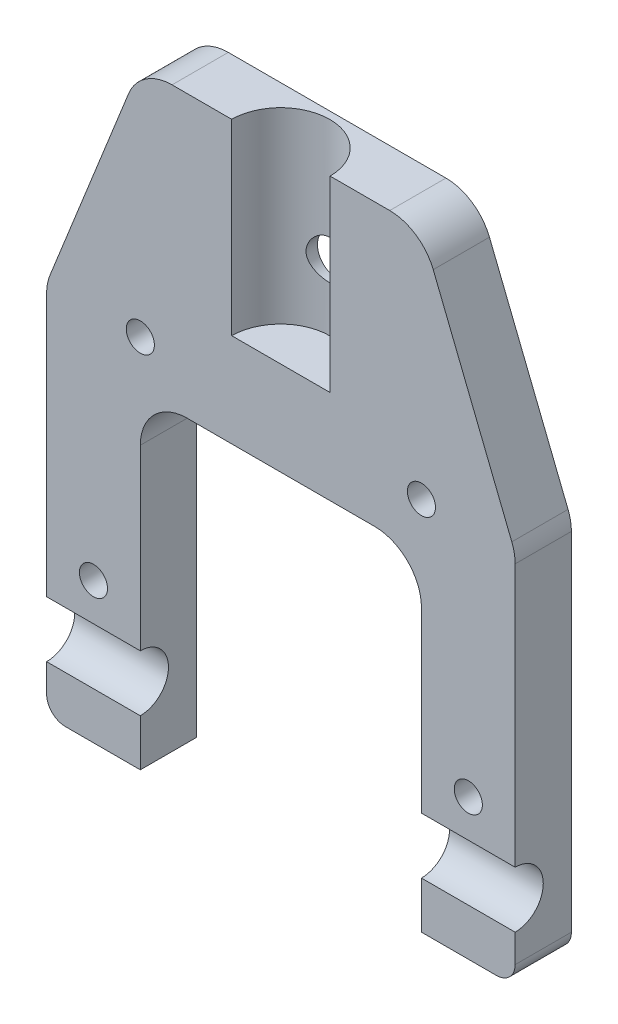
from build123d import *

# Parameters (mm, degrees)
ESQUISSE1_R             = 1.5
ESQUISSE1_R_2           = 2.1
EXTRUSION1_DEPTH        = 6
ESQUISSE4_R             = 5.25
ENL_V_MAT_EXTRU_2_DEPTH = 20
ENL_V_MAT_EXTRU_3_DEPTH = 10
ESQUISSE6_R             = 3
ENL_V_MAT_EXTRU_4_DEPTH = 83.225300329


with BuildPart() as part:
    # Esquisse1 → Extrusion1 (new body)
    with BuildSketch(Plane.XY):
        with BuildLine():
            Line((0, 2), (0, 39.037087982))
            ThreePointArc((0, 39.037087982), (0.090218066, 39.982625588), (0.357616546, 40.894041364))
            Line((0.357616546, 40.894041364), (8.742781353, 61.856953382))
            ThreePointArc((8.742781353, 61.856953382), (10.582020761, 64.140336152), (13.385164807, 65))
            Line((13.385164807, 65), (36.614835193, 65))
            ThreePointArc((36.614835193, 65), (39.417979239, 64.140336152), (41.257218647, 61.856953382))
            Line((41.257218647, 61.856953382), (49.642383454, 40.894041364))
            ThreePointArc((49.642383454, 40.894041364), (49.909781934, 39.982625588), (50, 39.037087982))
            Line((50, 39.037087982), (50, 2))
            ThreePointArc((50, 2), (49.414213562, 0.585786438), (48, 0))
            Line((48, 0), (2, 0))
            ThreePointArc((2, 0), (0.585786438, 0.585786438), (0, 2))
        make_face()
        with Locations((10, 40)):
            Circle(ESQUISSE1_R, mode=Mode.SUBTRACT)
        with Locations((40, 40)):
            Circle(ESQUISSE1_R, mode=Mode.SUBTRACT)
        with Locations((5, 15)):
            Circle(ESQUISSE1_R, mode=Mode.SUBTRACT)
        with Locations((45, 15)):
            Circle(ESQUISSE1_R, mode=Mode.SUBTRACT)
        with Locations((25, 52)):
            Circle(ESQUISSE1_R_2, mode=Mode.SUBTRACT)
    extrude(amount=EXTRUSION1_DEPTH)

    # Esquisse4 → Enl_v. mat.-Extru.2 (cut)
    with BuildSketch(Plane(origin=(0, 65, 0), x_dir=(-1, 0, 0), z_dir=(0, 1, 0))):
        with Locations((-25, 6.026163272)):
            Circle(ESQUISSE4_R)
    extrude(amount=-ENL_V_MAT_EXTRU_2_DEPTH, mode=Mode.SUBTRACT)

    # Esquisse5 → Enl_v. mat.-Extru.3 (cut)
    with BuildSketch(Plane.XY.offset(6)):
        with BuildLine():
            Line((15, 35), (35, 35))
            ThreePointArc((35, 35), (38.535533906, 33.535533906), (40, 30))
            Line((40, 30), (40, 0))
            Line((40, 0), (10, 0))
            Line((10, 0), (10, 30))
            ThreePointArc((10, 30), (11.464466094, 33.535533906), (15, 35))
        make_face()
    extrude(amount=-ENL_V_MAT_EXTRU_3_DEPTH, mode=Mode.SUBTRACT)

    # Esquisse6 → Enl_v. mat.-Extru.4 (cut, through all)
    with BuildSketch(Plane(origin=(50, 0, 0), x_dir=(0, 0, -1), z_dir=(1, 0, 0))):
        with Locations((-6, 8)):
            Circle(ESQUISSE6_R)
    extrude(amount=-ENL_V_MAT_EXTRU_4_DEPTH, mode=Mode.SUBTRACT)


solid = part.part
